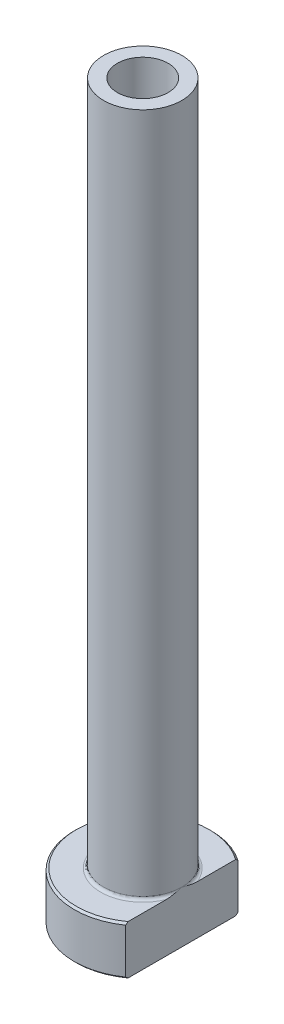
from build123d import *

# Parameters (mm, degrees)
FILLET1_R          = 0.3
CHAMFER1_SIZE      = 0.2
CUT_EXTRUDE1_DEPTH = 76.650512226
CHAMFER2_SIZE      = 0.5


with BuildPart() as part:
    # Sketch1 → Revolve1 (revolve)
    with BuildSketch(Plane.XY, mode=Mode.PRIVATE) as revolve1_sk:
        Polygon((-2.6, 75), (-4, 75), (-4, 5), (-7, 5), (-7, 0), (-2.85, 0), (-2.85, 18), (-2.6, 30), align=None)
    revolve(revolve1_sk.sketch.rotate(Axis((0, 92.187680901, 0), (0, -1, 0)), 270), axis=Axis((0, 92.187680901, 0), (0, -1, 0)))

    # Fillet1
    fillet1_edges = [part.edges().sort_by_distance(p)[0] for p in [
        (0, 5, -4),
    ]]
    fillet(fillet1_edges, radius=FILLET1_R)

    # Chamfer1
    chamfer1_edges = [part.edges().sort_by_distance(p)[0] for p in [
        (0, 0, -7),
        (0, 5, -7),
    ]]
    chamfer(chamfer1_edges, length=CHAMFER1_SIZE)

    # Sketch2 → Cut-Extrude1 (cut, through all)
    with BuildSketch(Plane.XZ):
        with BuildLine():
            Line((4, 5.744562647), (4, -5.744562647))
            ThreePointArc((4, -5.744562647), (7, 0), (4, 5.744562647))
        make_face()
    extrude(amount=-CUT_EXTRUDE1_DEPTH, mode=Mode.SUBTRACT)

    # Chamfer2
    chamfer2_edges = [part.edges().sort_by_distance(p)[0] for p in [
        (0, 0, -2.85),
    ]]
    chamfer(chamfer2_edges, length=CHAMFER2_SIZE)


solid = part.part
